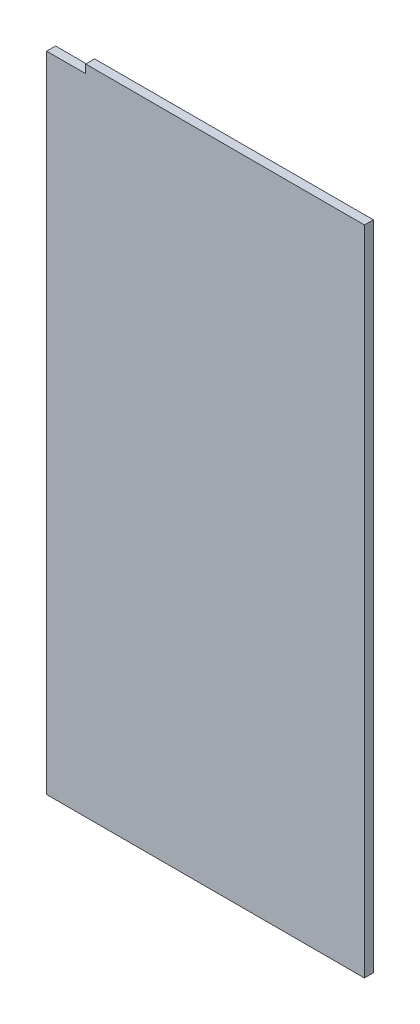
from build123d import *

# Parameters (mm, degrees)
EXTRUSION1_DEPTH = 16


with BuildPart() as part:
    # Esquisse1 → Extrusion1 (new body)
    with BuildSketch(Plane.XY):
        Polygon((0, 0), (570, 0), (570, 1170), (70, 1170), (70, 1155), (0, 1155), align=None)
    extrude(amount=EXTRUSION1_DEPTH)


solid = part.part
